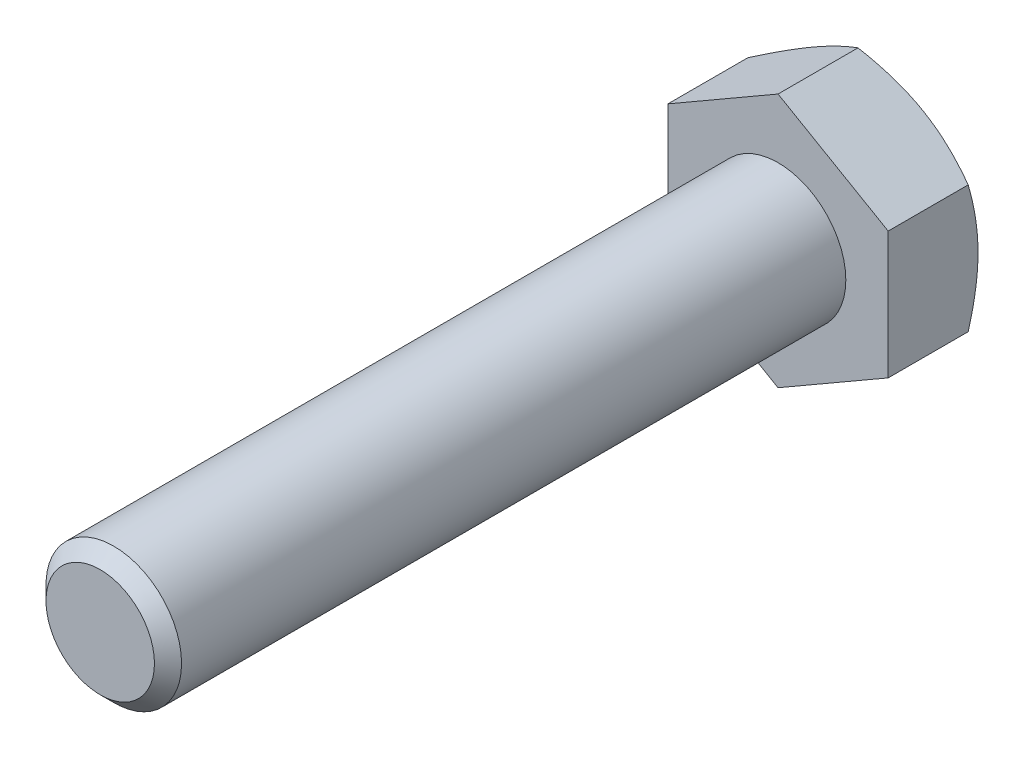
from build123d import *

# Parameters (mm, degrees)
ESQUISSE1_W        = 4
ESQUISSE1_H        = 40
CHANFREIN1_SIZE    = 0.8
BOSS_EXTRU_1_DEPTH = 5.3


with BuildPart() as part:
    # Esquisse1 → Base-R_volution (revolve)
    with BuildSketch(Plane(origin=(0, 0, 0), x_dir=(1, 0, 0), z_dir=(0, 1, 0))):
        with Locations((2, -20)):
            Rectangle(ESQUISSE1_W, ESQUISSE1_H)
    revolve(axis=Axis((0, 0, 0), (0, 0, 1)))

    # Chanfrein1
    chanfrein1_edges = [part.edges().sort_by_distance(p)[0] for p in [
        (-4, 0, 40),
    ]]
    chamfer(chanfrein1_edges, length=CHANFREIN1_SIZE)

    # Esquisse6 → Boss.-Extru.1 (add)
    with BuildSketch(Plane.XY):
        Polygon((6.5, -3.75277675), (6.5, 3.75277675), (0, 7.505553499), (-6.5, 3.75277675), (-6.5, -3.75277675), (0, -7.505553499), align=None)
    extrude(amount=-BOSS_EXTRU_1_DEPTH)

    # Esquisse7 → Enl_vement de mati_re-R_volution1 (revolve, cut)
    with BuildSketch(Plane(origin=(0, 0, 0), x_dir=(1, 0, 0), z_dir=(0, 1, 0))):
        Polygon((-6.5, 5.3), (-15.67986928, 5.3), (-15.67986928, 0), align=None)
    revolve(axis=Axis((0, 0, -6.239446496), (0, 0, 1)), mode=Mode.SUBTRACT)


solid = part.part
